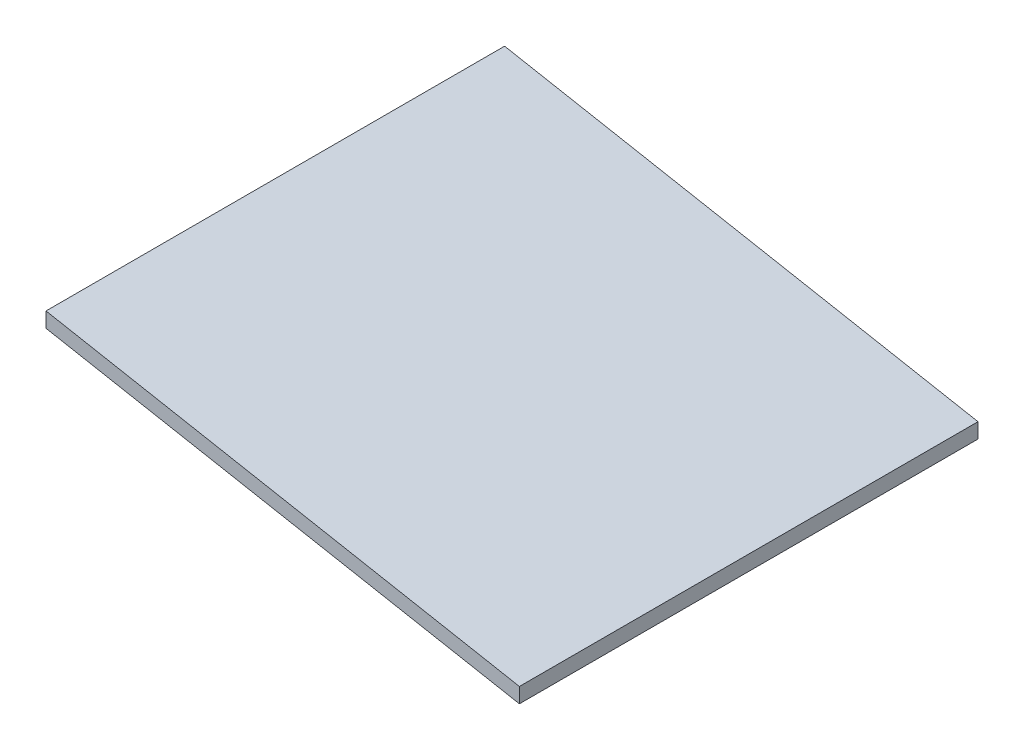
ISO-10303-21;
HEADER;
FILE_DESCRIPTION(('STEP AP214'),'2;1');
FILE_NAME('part.step','',(''),(''),'','','');
FILE_SCHEMA(('AUTOMOTIVE_DESIGN { 1 0 10303 214 1 1 1 1 }'));
ENDSEC;
DATA;
#1=APPLICATION_CONTEXT('core data for automotive mechanical design processes');
#2=APPLICATION_PROTOCOL_DEFINITION('international standard','automotive_design',2000,#1);
#3=PRODUCT_CONTEXT('',#1,'mechanical');
#4=PRODUCT('Part','Part','',(#3));
#5=PRODUCT_RELATED_PRODUCT_CATEGORY('part','',(#4));
#6=PRODUCT_DEFINITION_FORMATION('','',#4);
#7=PRODUCT_DEFINITION_CONTEXT('part definition',#1,'design');
#8=PRODUCT_DEFINITION('design','',#6,#7);
#9=PRODUCT_DEFINITION_SHAPE('','',#8);
#10=(LENGTH_UNIT() NAMED_UNIT(*) SI_UNIT(.MILLI.,.METRE.));
#11=(NAMED_UNIT(*) PLANE_ANGLE_UNIT() SI_UNIT($,.RADIAN.));
#12=(NAMED_UNIT(*) SI_UNIT($,.STERADIAN.) SOLID_ANGLE_UNIT());
#13=UNCERTAINTY_MEASURE_WITH_UNIT(LENGTH_MEASURE(1.E-05),#10,'distance_accuracy_value','');
#14=(GEOMETRIC_REPRESENTATION_CONTEXT(3) GLOBAL_UNCERTAINTY_ASSIGNED_CONTEXT((#13)) GLOBAL_UNIT_ASSIGNED_CONTEXT((#10,
#11,#12)) REPRESENTATION_CONTEXT('',''));
#15=CARTESIAN_POINT('',(0.,0.,0.));
#16=DIRECTION('',(0.,0.,1.));
#17=DIRECTION('',(1.,0.,0.));
#18=AXIS2_PLACEMENT_3D('',#15,#16,#17);
#19=CARTESIAN_POINT('',(203.2,247.870048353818,-822.409819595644));
#20=DIRECTION('',(-1.,0.,0.));
#21=DIRECTION('',(0.,0.,1.));
#22=AXIS2_PLACEMENT_3D('',#19,#20,#21);
#23=PLANE('',#22);
#24=DIRECTION('',(0.,-1.,0.));
#25=VECTOR('',#24,1.);
#26=CARTESIAN_POINT('',(203.2,247.870048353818,-406.4));
#27=LINE('',#26,#25);
#28=CARTESIAN_POINT('',(203.2,247.870048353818,-406.4));
#29=VERTEX_POINT('',#28);
#30=CARTESIAN_POINT('',(203.2,234.95,-406.4));
#31=VERTEX_POINT('',#30);
#32=EDGE_CURVE('E11',#29,#31,#27,.T.);
#33=ORIENTED_EDGE('',*,*,#32,.F.);
#34=DIRECTION('',(0.,0.,1.));
#35=VECTOR('',#34,1.);
#36=CARTESIAN_POINT('',(203.2,247.870048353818,-822.409819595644));
#37=LINE('',#36,#35);
#38=CARTESIAN_POINT('',(203.2,247.870048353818,-12.7));
#39=VERTEX_POINT('',#38);
#40=EDGE_CURVE('E101',#29,#39,#37,.T.);
#41=ORIENTED_EDGE('',*,*,#40,.T.);
#42=DIRECTION('',(0.,1.,0.));
#43=VECTOR('',#42,1.);
#44=CARTESIAN_POINT('',(203.2,247.870048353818,-12.7));
#45=LINE('',#44,#43);
#46=CARTESIAN_POINT('',(203.2,234.95,-12.7));
#47=VERTEX_POINT('',#46);
#48=EDGE_CURVE('E86',#47,#39,#45,.T.);
#49=ORIENTED_EDGE('',*,*,#48,.F.);
#50=DIRECTION('',(0.,0.,1.));
#51=VECTOR('',#50,1.);
#52=CARTESIAN_POINT('',(203.2,234.95,-822.409819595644));
#53=LINE('',#52,#51);
#54=EDGE_CURVE('E99',#31,#47,#53,.T.);
#55=ORIENTED_EDGE('',*,*,#54,.F.);
#56=EDGE_LOOP('',(#33,#41,#49,#55));
#57=FACE_BOUND('',#56,.T.);
#58=ADVANCED_FACE('F31',(#57),#23,.F.);
#59=CARTESIAN_POINT('',(203.2,234.95,-822.409819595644));
#60=DIRECTION('',(0.183774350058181,0.982968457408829,0.));
#61=DIRECTION('',(-0.982968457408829,0.183774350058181,0.));
#62=AXIS2_PLACEMENT_3D('',#59,#60,#61);
#63=PLANE('',#62);
#64=DIRECTION('',(-0.982968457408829,0.183774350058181,0.));
#65=VECTOR('',#64,1.);
#66=CARTESIAN_POINT('',(203.2,234.95,-406.4));
#67=LINE('',#66,#65);
#68=CARTESIAN_POINT('',(-203.2,310.929951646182,-406.4));
#69=VERTEX_POINT('',#68);
#70=EDGE_CURVE('E35',#31,#69,#67,.T.);
#71=ORIENTED_EDGE('',*,*,#70,.F.);
#72=ORIENTED_EDGE('',*,*,#54,.T.);
#73=DIRECTION('',(0.982968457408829,-0.183774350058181,0.));
#74=VECTOR('',#73,1.);
#75=CARTESIAN_POINT('',(203.2,234.95,-12.7));
#76=LINE('',#75,#74);
#77=CARTESIAN_POINT('',(-203.2,310.929951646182,-12.7));
#78=VERTEX_POINT('',#77);
#79=EDGE_CURVE('E90',#78,#47,#76,.T.);
#80=ORIENTED_EDGE('',*,*,#79,.F.);
#81=DIRECTION('',(0.,0.,1.));
#82=VECTOR('',#81,1.);
#83=CARTESIAN_POINT('',(-203.2,310.929951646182,-822.409819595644));
#84=LINE('',#83,#82);
#85=EDGE_CURVE('E76',#69,#78,#84,.T.);
#86=ORIENTED_EDGE('',*,*,#85,.F.);
#87=EDGE_LOOP('',(#71,#72,#80,#86));
#88=FACE_BOUND('',#87,.T.);
#89=ADVANCED_FACE('F105',(#88),#63,.F.);
#90=CARTESIAN_POINT('',(-203.2,323.85,-822.409819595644));
#91=DIRECTION('',(1.,0.,0.));
#92=DIRECTION('',(0.,0.,-1.));
#93=AXIS2_PLACEMENT_3D('',#90,#91,#92);
#94=PLANE('',#93);
#95=DIRECTION('',(0.,1.,0.));
#96=VECTOR('',#95,1.);
#97=CARTESIAN_POINT('',(-203.2,323.85,-406.4));
#98=LINE('',#97,#96);
#99=CARTESIAN_POINT('',(-203.2,323.85,-406.4));
#100=VERTEX_POINT('',#99);
#101=EDGE_CURVE('E95',#69,#100,#98,.T.);
#102=ORIENTED_EDGE('',*,*,#101,.F.);
#103=ORIENTED_EDGE('',*,*,#85,.T.);
#104=DIRECTION('',(0.,-1.,0.));
#105=VECTOR('',#104,1.);
#106=CARTESIAN_POINT('',(-203.2,323.85,-12.7));
#107=LINE('',#106,#105);
#108=CARTESIAN_POINT('',(-203.2,323.85,-12.7));
#109=VERTEX_POINT('',#108);
#110=EDGE_CURVE('E83',#109,#78,#107,.T.);
#111=ORIENTED_EDGE('',*,*,#110,.F.);
#112=DIRECTION('',(0.,0.,1.));
#113=VECTOR('',#112,1.);
#114=CARTESIAN_POINT('',(-203.2,323.85,-822.409819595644));
#115=LINE('',#114,#113);
#116=EDGE_CURVE('E68',#100,#109,#115,.T.);
#117=ORIENTED_EDGE('',*,*,#116,.F.);
#118=EDGE_LOOP('',(#102,#103,#111,#117));
#119=FACE_BOUND('',#118,.T.);
#120=ADVANCED_FACE('F88',(#119),#94,.F.);
#121=CARTESIAN_POINT('',(203.2,247.870048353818,-822.409819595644));
#122=DIRECTION('',(-0.183774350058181,-0.982968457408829,0.));
#123=DIRECTION('',(0.982968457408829,-0.183774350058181,0.));
#124=AXIS2_PLACEMENT_3D('',#121,#122,#123);
#125=PLANE('',#124);
#126=DIRECTION('',(0.982968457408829,-0.183774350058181,0.));
#127=VECTOR('',#126,1.);
#128=CARTESIAN_POINT('',(203.2,247.870048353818,-406.4));
#129=LINE('',#128,#127);
#130=EDGE_CURVE('E41',#100,#29,#129,.T.);
#131=ORIENTED_EDGE('',*,*,#130,.F.);
#132=ORIENTED_EDGE('',*,*,#116,.T.);
#133=DIRECTION('',(-0.982968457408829,0.183774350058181,0.));
#134=VECTOR('',#133,1.);
#135=CARTESIAN_POINT('',(203.2,247.870048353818,-12.7));
#136=LINE('',#135,#134);
#137=EDGE_CURVE('E72',#39,#109,#136,.T.);
#138=ORIENTED_EDGE('',*,*,#137,.F.);
#139=ORIENTED_EDGE('',*,*,#40,.F.);
#140=EDGE_LOOP('',(#131,#132,#138,#139));
#141=FACE_BOUND('',#140,.T.);
#142=ADVANCED_FACE('F70',(#141),#125,.F.);
#143=CARTESIAN_POINT('',(203.2,234.95,-406.4));
#144=DIRECTION('',(0.,0.,-1.));
#145=DIRECTION('',(-1.,0.,0.));
#146=AXIS2_PLACEMENT_3D('',#143,#144,#145);
#147=PLANE('',#146);
#148=ORIENTED_EDGE('',*,*,#70,.T.);
#149=ORIENTED_EDGE('',*,*,#101,.T.);
#150=ORIENTED_EDGE('',*,*,#130,.T.);
#151=ORIENTED_EDGE('',*,*,#32,.T.);
#152=EDGE_LOOP('',(#148,#149,#150,#151));
#153=FACE_BOUND('',#152,.T.);
#154=ADVANCED_FACE('F33',(#153),#147,.T.);
#155=CARTESIAN_POINT('',(203.2,-374.65,-12.7));
#156=DIRECTION('',(0.,0.,-1.));
#157=DIRECTION('',(-1.,0.,0.));
#158=AXIS2_PLACEMENT_3D('',#155,#156,#157);
#159=PLANE('',#158);
#160=ORIENTED_EDGE('',*,*,#137,.T.);
#161=ORIENTED_EDGE('',*,*,#110,.T.);
#162=ORIENTED_EDGE('',*,*,#79,.T.);
#163=ORIENTED_EDGE('',*,*,#48,.T.);
#164=EDGE_LOOP('',(#160,#161,#162,#163));
#165=FACE_BOUND('',#164,.T.);
#166=ADVANCED_FACE('F81',(#165),#159,.F.);
#167=CLOSED_SHELL('',(#58,#89,#120,#142,#154,#166));
#168=MANIFOLD_SOLID_BREP('B2',#167);
#169=ADVANCED_BREP_SHAPE_REPRESENTATION('',(#18,#168),#14);
#170=SHAPE_DEFINITION_REPRESENTATION(#9,#169);
ENDSEC;
END-ISO-10303-21;
